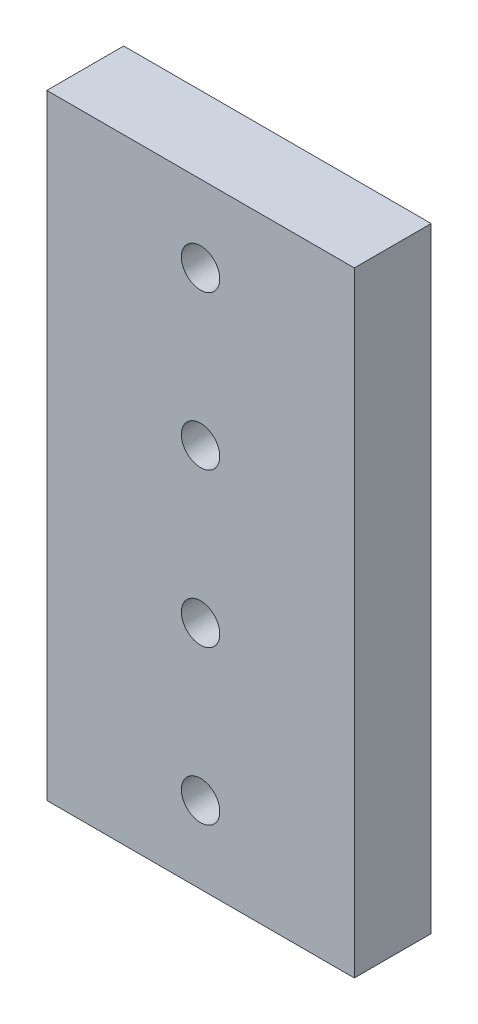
from build123d import *

# Parameters (mm, degrees)
SKETCH1_W           = 25.4
SKETCH1_H           = 50.8
BOSS_EXTRUDE1_DEPTH = 3.175
SKETCH3_R           = 1.5875
CUT_EXTRUDE2_DEPTH  = 30.099355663
LPATTERN1_COUNT     = 4
LPATTERN1_PITCH     = 12.7


with BuildPart() as part:
    # Sketch1 → Boss-Extrude1 (new, symmetric)
    with BuildSketch(Plane.XY):
        Rectangle(SKETCH1_W, SKETCH1_H)
    extrude(amount=BOSS_EXTRUDE1_DEPTH, both=True)

    # Sketch3 → Cut-Extrude2 (cut, through all)
    with BuildSketch(Plane(origin=(0, 0, -3.175), x_dir=(-1, 0, 0), z_dir=(0, 0, -1))):
        with Locations((0, 19.05)):
            Circle(SKETCH3_R)
    cut_extrude2 = extrude(amount=-CUT_EXTRUDE2_DEPTH, mode=Mode.SUBTRACT)

    # LPattern1: Cut-Extrude2 ×4
    with Locations(*[(0, -i * LPATTERN1_PITCH, 0) for i in range(1, LPATTERN1_COUNT)]):
        add(cut_extrude2, mode=Mode.SUBTRACT)


solid = part.part
